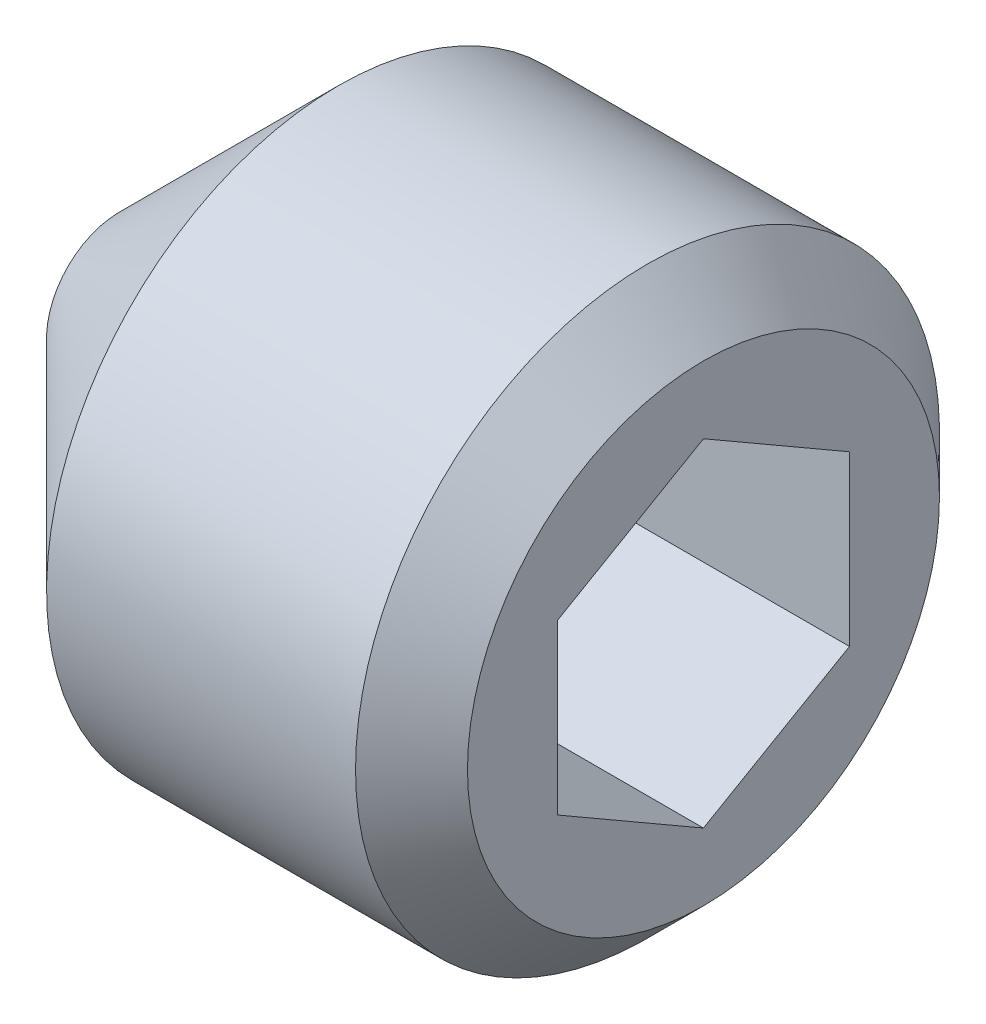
ISO-10303-21;
HEADER;
FILE_DESCRIPTION(('STEP AP214'),'2;1');
FILE_NAME('part.step','',(''),(''),'','','');
FILE_SCHEMA(('AUTOMOTIVE_DESIGN { 1 0 10303 214 1 1 1 1 }'));
ENDSEC;
DATA;
#1=APPLICATION_CONTEXT('core data for automotive mechanical design processes');
#2=APPLICATION_PROTOCOL_DEFINITION('international standard','automotive_design',2000,#1);
#3=PRODUCT_CONTEXT('',#1,'mechanical');
#4=PRODUCT('Part','Part','',(#3));
#5=PRODUCT_RELATED_PRODUCT_CATEGORY('part','',(#4));
#6=PRODUCT_DEFINITION_FORMATION('','',#4);
#7=PRODUCT_DEFINITION_CONTEXT('part definition',#1,'design');
#8=PRODUCT_DEFINITION('design','',#6,#7);
#9=PRODUCT_DEFINITION_SHAPE('','',#8);
#10=(LENGTH_UNIT() NAMED_UNIT(*) SI_UNIT(.MILLI.,.METRE.));
#11=(NAMED_UNIT(*) PLANE_ANGLE_UNIT() SI_UNIT($,.RADIAN.));
#12=(NAMED_UNIT(*) SI_UNIT($,.STERADIAN.) SOLID_ANGLE_UNIT());
#13=UNCERTAINTY_MEASURE_WITH_UNIT(LENGTH_MEASURE(1.E-05),#10,'distance_accuracy_value','');
#14=(GEOMETRIC_REPRESENTATION_CONTEXT(3) GLOBAL_UNCERTAINTY_ASSIGNED_CONTEXT((#13)) GLOBAL_UNIT_ASSIGNED_CONTEXT((#10,
#11,#12)) REPRESENTATION_CONTEXT('',''));
#15=CARTESIAN_POINT('',(0.,0.,0.));
#16=DIRECTION('',(0.,0.,1.));
#17=DIRECTION('',(1.,0.,0.));
#18=AXIS2_PLACEMENT_3D('',#15,#16,#17);
#19=CARTESIAN_POINT('',(3.00800000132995,0.,0.));
#20=DIRECTION('',(1.,0.,0.));
#21=DIRECTION('',(0.,0.,-1.));
#22=AXIS2_PLACEMENT_3D('',#19,#20,#21);
#23=CONICAL_SURFACE('',#22,2.32325748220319,1.04719754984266);
#24=CARTESIAN_POINT('',(1.66666666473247,-2.27373675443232E-10,0.));
#25=VERTEX_POINT('',#24);
#26=VERTEX_LOOP('',#25);
#27=FACE_BOUND('',#26,.T.);
#28=CARTESIAN_POINT('',(3.0000000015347,-1.15470053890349,1.9999999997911));
#29=CARTESIAN_POINT('',(2.97069554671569,-1.20544263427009,1.91211211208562));
#30=CARTESIAN_POINT('',(2.94404467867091,-1.25662273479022,1.82346557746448));
#31=CARTESIAN_POINT('',(2.89752638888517,-1.35986908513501,1.6446376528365));
#32=CARTESIAN_POINT('',(2.87767542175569,-1.4119371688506,1.55445308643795));
#33=CARTESIAN_POINT('',(2.84677596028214,-1.51542808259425,1.37520156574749));
#34=CARTESIAN_POINT('',(2.83552178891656,-1.56683499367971,1.28616218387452));
#35=CARTESIAN_POINT('',(2.82208916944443,-1.66989057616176,1.10766467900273));
#36=CARTESIAN_POINT('',(2.81989959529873,-1.72153887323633,1.01820720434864));
#37=CARTESIAN_POINT('',(2.82446629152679,-1.81803817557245,0.8510655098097));
#38=CARTESIAN_POINT('',(2.83010128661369,-1.86290366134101,0.773356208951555));
#39=CARTESIAN_POINT('',(2.84795730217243,-1.95234234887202,0.618443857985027));
#40=CARTESIAN_POINT('',(2.86018441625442,-1.99691524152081,0.541241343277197));
#41=CARTESIAN_POINT('',(2.89074983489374,-2.08653818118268,0.386009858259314));
#42=CARTESIAN_POINT('',(2.90921764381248,-2.1315768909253,0.308000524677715));
#43=CARTESIAN_POINT('',(2.95113176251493,-2.220982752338,0.153145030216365));
#44=CARTESIAN_POINT('',(2.97456823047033,-2.26535104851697,0.076296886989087));
#45=CARTESIAN_POINT('',(3.00000000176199,-2.30940107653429,3.8833644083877E-10));
#46=B_SPLINE_CURVE_WITH_KNOTS('',3,(#28,#29,#30,#31,#32,#33,#34,#35,#36,#37,#38,#39,#40,#41,#42,
#43,#44,#45),.UNSPECIFIED.,.F.,.F.,(4,2,2,2,2,2,2,2,4),(0.,0.317016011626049,0.634793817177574,
0.944707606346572,1.25424088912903,1.52370778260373,1.79342419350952,2.06912162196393,
2.34427797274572),.UNSPECIFIED.);
#47=CARTESIAN_POINT('',(3.00000000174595,-1.15470053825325,1.99999999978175));
#48=VERTEX_POINT('',#47);
#49=CARTESIAN_POINT('',(3.00000000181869,-2.3094010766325,2.1823843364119E-10));
#50=VERTEX_POINT('',#49);
#51=EDGE_CURVE('E20',#48,#50,#46,.T.);
#52=ORIENTED_EDGE('',*,*,#51,.T.);
#53=CARTESIAN_POINT('',(3.0000000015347,-2.30940107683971,-5.5845519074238E-10));
#54=CARTESIAN_POINT('',(2.97069554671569,-2.25865898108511,-0.0878878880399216));
#55=CARTESIAN_POINT('',(2.94404467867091,-2.20747888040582,-0.176534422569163));
#56=CARTESIAN_POINT('',(2.89752638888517,-2.10423252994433,-0.355362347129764));
#57=CARTESIAN_POINT('',(2.87767542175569,-2.0521644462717,-0.445546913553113));
#58=CARTESIAN_POINT('',(2.84677596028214,-1.94867353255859,-0.624798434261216));
#59=CARTESIAN_POINT('',(2.83552178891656,-1.89726662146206,-0.713837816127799));
#60=CARTESIAN_POINT('',(2.82208916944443,-1.79421103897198,-0.892335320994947));
#61=CARTESIAN_POINT('',(2.81989959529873,-1.74256274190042,-0.981792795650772));
#62=CARTESIAN_POINT('',(2.82446629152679,-1.64606343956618,-1.1489344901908));
#63=CARTESIAN_POINT('',(2.83010128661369,-1.60119795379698,-1.22664379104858));
#64=CARTESIAN_POINT('',(2.84795730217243,-1.5117592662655,-1.38155614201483));
#65=CARTESIAN_POINT('',(2.86018441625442,-1.46718637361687,-1.45875865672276));
#66=CARTESIAN_POINT('',(2.89074983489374,-1.37756343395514,-1.61399014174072));
#67=CARTESIAN_POINT('',(2.90921764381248,-1.33252472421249,-1.6919994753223));
#68=CARTESIAN_POINT('',(2.95113176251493,-1.24311886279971,-1.84685496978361));
#69=CARTESIAN_POINT('',(2.97456823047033,-1.19875056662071,-1.92370311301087));
#70=CARTESIAN_POINT('',(3.00000000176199,-1.15470053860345,-1.99999999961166));
#71=B_SPLINE_CURVE_WITH_KNOTS('',3,(#53,#54,#55,#56,#57,#58,#59,#60,#61,#62,#63,#64,#65,#66,#67,
#68,#69,#70),.UNSPECIFIED.,.F.,.F.,(4,2,2,2,2,2,2,2,4),(0.,0.31701601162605,0.634793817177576,
0.944707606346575,1.25424088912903,1.52370778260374,1.79342419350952,2.06912162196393,
2.34427797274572),.UNSPECIFIED.);
#72=CARTESIAN_POINT('',(3.00000000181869,-1.15470053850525,-1.99999999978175));
#73=VERTEX_POINT('',#72);
#74=EDGE_CURVE('E110',#50,#73,#71,.T.);
#75=ORIENTED_EDGE('',*,*,#74,.T.);
#76=CARTESIAN_POINT('',(3.0000000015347,-1.15470053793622,-2.00000000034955));
#77=CARTESIAN_POINT('',(2.97069554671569,-1.05321634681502,-2.00000000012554));
#78=CARTESIAN_POINT('',(2.94404467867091,-0.950856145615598,-2.00000000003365));
#79=CARTESIAN_POINT('',(2.89752638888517,-0.744363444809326,-1.99999999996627));
#80=CARTESIAN_POINT('',(2.87767542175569,-0.640227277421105,-1.99999999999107));
#81=CARTESIAN_POINT('',(2.84677596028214,-0.433245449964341,-2.00000000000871));
#82=CARTESIAN_POINT('',(2.83552178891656,-0.330431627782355,-2.00000000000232));
#83=CARTESIAN_POINT('',(2.82208916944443,-0.124320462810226,-1.99999999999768));
#84=CARTESIAN_POINT('',(2.81989959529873,-0.0210238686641,-1.99999999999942));
#85=CARTESIAN_POINT('',(2.82446629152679,0.171974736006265,-2.0000000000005));
#86=CARTESIAN_POINT('',(2.83010128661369,0.261705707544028,-2.00000000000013));
#87=CARTESIAN_POINT('',(2.84795730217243,0.440583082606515,-1.99999999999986));
#88=CARTESIAN_POINT('',(2.86018441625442,0.529728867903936,-1.99999999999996));
#89=CARTESIAN_POINT('',(2.89074983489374,0.708974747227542,-2.00000000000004));
#90=CARTESIAN_POINT('',(2.90921764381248,0.799052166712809,-2.00000000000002));
#91=CARTESIAN_POINT('',(2.95113176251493,0.977863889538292,-1.99999999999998));
#92=CARTESIAN_POINT('',(2.97456823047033,1.06660048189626,-1.99999999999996));
#93=CARTESIAN_POINT('',(3.00000000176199,1.15470053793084,-2.));
#94=B_SPLINE_CURVE_WITH_KNOTS('',3,(#76,#77,#78,#79,#80,#81,#82,#83,#84,#85,#86,#87,#88,#89,#90,
#91,#92,#93),.UNSPECIFIED.,.F.,.F.,(4,2,2,2,2,2,2,2,4),(0.,0.31701601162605,0.634793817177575,
0.944707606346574,1.25424088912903,1.52370778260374,1.79342419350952,2.06912162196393,
2.34427797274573),.UNSPECIFIED.);
#95=CARTESIAN_POINT('',(3.00000000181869,1.15470053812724,-1.99999999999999));
#96=VERTEX_POINT('',#95);
#97=EDGE_CURVE('E106',#73,#96,#94,.T.);
#98=ORIENTED_EDGE('',*,*,#97,.T.);
#99=CARTESIAN_POINT('',(3.00000000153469,1.15470053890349,-1.9999999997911));
#100=CARTESIAN_POINT('',(2.97069554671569,1.20544263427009,-1.91211211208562));
#101=CARTESIAN_POINT('',(2.94404467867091,1.25662273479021,-1.82346557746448));
#102=CARTESIAN_POINT('',(2.89752638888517,1.359869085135,-1.6446376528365));
#103=CARTESIAN_POINT('',(2.87767542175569,1.41193716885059,-1.55445308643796));
#104=CARTESIAN_POINT('',(2.84677596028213,1.51542808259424,-1.37520156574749));
#105=CARTESIAN_POINT('',(2.83552178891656,1.5668349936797,-1.28616218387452));
#106=CARTESIAN_POINT('',(2.82208916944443,1.66989057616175,-1.10766467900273));
#107=CARTESIAN_POINT('',(2.81989959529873,1.72153887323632,-1.01820720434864));
#108=CARTESIAN_POINT('',(2.82446629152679,1.81803817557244,-0.851065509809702));
#109=CARTESIAN_POINT('',(2.83010128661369,1.862903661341,-0.773356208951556));
#110=CARTESIAN_POINT('',(2.84795730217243,1.95234234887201,-0.618443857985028));
#111=CARTESIAN_POINT('',(2.86018441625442,1.9969152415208,-0.541241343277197));
#112=CARTESIAN_POINT('',(2.89074983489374,2.08653818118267,-0.386009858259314));
#113=CARTESIAN_POINT('',(2.90921764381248,2.13157689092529,-0.308000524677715));
#114=CARTESIAN_POINT('',(2.95113176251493,2.220982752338,-0.153145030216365));
#115=CARTESIAN_POINT('',(2.97456823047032,2.26535104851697,-0.0762968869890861));
#116=CARTESIAN_POINT('',(3.00000000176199,2.30940107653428,-3.88335300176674E-10));
#117=B_SPLINE_CURVE_WITH_KNOTS('',3,(#99,#100,#101,#102,#103,#104,#105,#106,#107,#108,#109,#110,
#111,#112,#113,#114,#115,#116),.UNSPECIFIED.,.F.,.F.,(4,2,2,2,2,2,2,2,4),(0.,0.317016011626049,
0.634793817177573,0.944707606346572,1.25424088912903,1.52370778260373,1.79342419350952,
2.06912162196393,2.34427797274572),.UNSPECIFIED.);
#118=CARTESIAN_POINT('',(3.00000000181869,2.30940107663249,-2.1824186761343E-10));
#119=VERTEX_POINT('',#118);
#120=EDGE_CURVE('E102',#96,#119,#117,.T.);
#121=ORIENTED_EDGE('',*,*,#120,.T.);
#122=CARTESIAN_POINT('',(3.00000000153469,2.3094010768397,5.58452293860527E-10));
#123=CARTESIAN_POINT('',(2.97069554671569,2.25865898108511,0.0878878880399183));
#124=CARTESIAN_POINT('',(2.94404467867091,2.20747888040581,0.176534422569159));
#125=CARTESIAN_POINT('',(2.89752638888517,2.10423252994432,0.355362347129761));
#126=CARTESIAN_POINT('',(2.87767542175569,2.05216444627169,0.445546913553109));
#127=CARTESIAN_POINT('',(2.84677596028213,1.94867353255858,0.624798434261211));
#128=CARTESIAN_POINT('',(2.83552178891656,1.89726662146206,0.713837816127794));
#129=CARTESIAN_POINT('',(2.82208916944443,1.79421103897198,0.892335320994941));
#130=CARTESIAN_POINT('',(2.81989959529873,1.74256274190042,0.981792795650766));
#131=CARTESIAN_POINT('',(2.82446629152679,1.64606343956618,1.1489344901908));
#132=CARTESIAN_POINT('',(2.83010128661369,1.60119795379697,1.22664379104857));
#133=CARTESIAN_POINT('',(2.84795730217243,1.51175926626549,1.38155614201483));
#134=CARTESIAN_POINT('',(2.86018441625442,1.46718637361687,1.45875865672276));
#135=CARTESIAN_POINT('',(2.89074983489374,1.37756343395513,1.61399014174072));
#136=CARTESIAN_POINT('',(2.90921764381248,1.33252472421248,1.6919994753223));
#137=CARTESIAN_POINT('',(2.95113176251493,1.2431188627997,1.84685496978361));
#138=CARTESIAN_POINT('',(2.97456823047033,1.1987505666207,1.92370311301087));
#139=CARTESIAN_POINT('',(3.00000000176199,1.15470053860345,1.99999999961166));
#140=B_SPLINE_CURVE_WITH_KNOTS('',3,(#122,#123,#124,#125,#126,#127,#128,#129,#130,#131,#132,
#133,#134,#135,#136,#137,#138,#139),.UNSPECIFIED.,.F.,.F.,(4,2,2,2,2,2,2,2,4),(0.,
0.317016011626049,0.634793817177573,0.944707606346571,1.25424088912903,1.52370778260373,
1.79342419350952,2.06912162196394,2.34427797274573),.UNSPECIFIED.);
#141=CARTESIAN_POINT('',(3.00000000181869,1.15470053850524,1.99999999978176));
#142=VERTEX_POINT('',#141);
#143=EDGE_CURVE('E85',#119,#142,#140,.T.);
#144=ORIENTED_EDGE('',*,*,#143,.T.);
#145=CARTESIAN_POINT('',(3.00000000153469,1.15470053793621,2.00000000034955));
#146=CARTESIAN_POINT('',(2.97069554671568,1.05321634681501,2.00000000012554));
#147=CARTESIAN_POINT('',(2.94404467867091,0.950856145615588,2.00000000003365));
#148=CARTESIAN_POINT('',(2.89752638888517,0.744363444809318,1.99999999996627));
#149=CARTESIAN_POINT('',(2.87767542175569,0.640227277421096,1.99999999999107));
#150=CARTESIAN_POINT('',(2.84677596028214,0.433245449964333,2.00000000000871));
#151=CARTESIAN_POINT('',(2.83552178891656,0.330431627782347,2.00000000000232));
#152=CARTESIAN_POINT('',(2.82208916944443,0.12432046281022,1.99999999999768));
#153=CARTESIAN_POINT('',(2.81989959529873,0.0210238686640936,1.99999999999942));
#154=CARTESIAN_POINT('',(2.82446629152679,-0.171974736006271,2.0000000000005));
#155=CARTESIAN_POINT('',(2.83010128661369,-0.261705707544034,2.00000000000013));
#156=CARTESIAN_POINT('',(2.84795730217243,-0.440583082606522,1.99999999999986));
#157=CARTESIAN_POINT('',(2.86018441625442,-0.529728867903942,1.99999999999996));
#158=CARTESIAN_POINT('',(2.89074983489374,-0.708974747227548,2.00000000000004));
#159=CARTESIAN_POINT('',(2.90921764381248,-0.799052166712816,2.00000000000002));
#160=CARTESIAN_POINT('',(2.95113176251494,-0.977863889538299,1.99999999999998));
#161=CARTESIAN_POINT('',(2.97456823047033,-1.06660048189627,1.99999999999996));
#162=CARTESIAN_POINT('',(3.000000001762,-1.15470053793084,2.));
#163=B_SPLINE_CURVE_WITH_KNOTS('',3,(#145,#146,#147,#148,#149,#150,#151,#152,#153,#154,#155,
#156,#157,#158,#159,#160,#161,#162),.UNSPECIFIED.,.F.,.F.,(4,2,2,2,2,2,2,2,4),(0.,
0.317016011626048,0.634793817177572,0.944707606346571,1.25424088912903,1.52370778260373,
1.79342419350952,2.06912162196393,2.34427797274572),.UNSPECIFIED.);
#164=EDGE_CURVE('E83',#142,#48,#163,.T.);
#165=ORIENTED_EDGE('',*,*,#164,.T.);
#166=EDGE_LOOP('',(#52,#75,#98,#121,#144,#165));
#167=FACE_BOUND('',#166,.T.);
#168=ADVANCED_FACE('F16',(#27,#167),#23,.F.);
#169=CARTESIAN_POINT('',(8.,-1.15470053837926,1.99999999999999));
#170=DIRECTION('',(0.,-0.86602540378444,0.499999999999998));
#171=DIRECTION('',(0.,-0.499999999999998,-0.86602540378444));
#172=AXIS2_PLACEMENT_3D('',#169,#170,#171);
#173=PLANE('',#172);
#174=DIRECTION('',(1.,0.,0.));
#175=VECTOR('',#174,1.);
#176=CARTESIAN_POINT('',(8.,-1.15470053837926,2.));
#177=LINE('',#176,#175);
#178=CARTESIAN_POINT('',(8.,-1.15470053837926,2.));
#179=VERTEX_POINT('',#178);
#180=EDGE_CURVE('E76',#48,#179,#177,.T.);
#181=ORIENTED_EDGE('',*,*,#180,.T.);
#182=DIRECTION('',(0.,-0.499999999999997,-0.86602540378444));
#183=VECTOR('',#182,1.);
#184=CARTESIAN_POINT('',(8.,-1.15470053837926,1.99999999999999));
#185=LINE('',#184,#183);
#186=CARTESIAN_POINT('',(8.,-2.3094010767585,0.));
#187=VERTEX_POINT('',#186);
#188=EDGE_CURVE('E87',#179,#187,#185,.T.);
#189=ORIENTED_EDGE('',*,*,#188,.T.);
#190=DIRECTION('',(1.,0.,0.));
#191=VECTOR('',#190,1.);
#192=CARTESIAN_POINT('',(8.,-2.3094010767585,0.));
#193=LINE('',#192,#191);
#194=EDGE_CURVE('E79',#187,#50,#193,.F.);
#195=ORIENTED_EDGE('',*,*,#194,.T.);
#196=ORIENTED_EDGE('',*,*,#51,.F.);
#197=EDGE_LOOP('',(#181,#189,#195,#196));
#198=FACE_BOUND('',#197,.T.);
#199=ADVANCED_FACE('F74',(#198),#173,.F.);
#200=CARTESIAN_POINT('',(8.,-2.3094010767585,0.));
#201=DIRECTION('',(0.,-0.866025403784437,-0.500000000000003));
#202=DIRECTION('',(0.,0.500000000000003,-0.866025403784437));
#203=AXIS2_PLACEMENT_3D('',#200,#201,#202);
#204=PLANE('',#203);
#205=ORIENTED_EDGE('',*,*,#194,.F.);
#206=DIRECTION('',(0.,0.500000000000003,-0.866025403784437));
#207=VECTOR('',#206,1.);
#208=CARTESIAN_POINT('',(8.,-2.3094010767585,0.));
#209=LINE('',#208,#207);
#210=CARTESIAN_POINT('',(8.,-1.15470053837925,-2.));
#211=VERTEX_POINT('',#210);
#212=EDGE_CURVE('E117',#187,#211,#209,.T.);
#213=ORIENTED_EDGE('',*,*,#212,.T.);
#214=DIRECTION('',(-1.,0.,0.));
#215=VECTOR('',#214,1.);
#216=CARTESIAN_POINT('',(8.,-1.15470053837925,-2.));
#217=LINE('',#216,#215);
#218=EDGE_CURVE('E107',#211,#73,#217,.T.);
#219=ORIENTED_EDGE('',*,*,#218,.T.);
#220=ORIENTED_EDGE('',*,*,#74,.F.);
#221=EDGE_LOOP('',(#205,#213,#219,#220));
#222=FACE_BOUND('',#221,.T.);
#223=ADVANCED_FACE('F162',(#222),#204,.F.);
#224=CARTESIAN_POINT('',(8.,-1.15470053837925,-2.));
#225=DIRECTION('',(0.,0.,-1.));
#226=DIRECTION('',(-1.,0.,0.));
#227=AXIS2_PLACEMENT_3D('',#224,#225,#226);
#228=PLANE('',#227);
#229=ORIENTED_EDGE('',*,*,#218,.F.);
#230=DIRECTION('',(0.,1.,0.));
#231=VECTOR('',#230,1.);
#232=CARTESIAN_POINT('',(8.,0.,-2.));
#233=LINE('',#232,#231);
#234=CARTESIAN_POINT('',(8.,1.15470053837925,-1.99999999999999));
#235=VERTEX_POINT('',#234);
#236=EDGE_CURVE('E119',#211,#235,#233,.T.);
#237=ORIENTED_EDGE('',*,*,#236,.T.);
#238=DIRECTION('',(1.,0.,0.));
#239=VECTOR('',#238,1.);
#240=CARTESIAN_POINT('',(8.,1.15470053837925,-1.99999999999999));
#241=LINE('',#240,#239);
#242=EDGE_CURVE('E103',#235,#96,#241,.F.);
#243=ORIENTED_EDGE('',*,*,#242,.T.);
#244=ORIENTED_EDGE('',*,*,#97,.F.);
#245=EDGE_LOOP('',(#229,#237,#243,#244));
#246=FACE_BOUND('',#245,.T.);
#247=ADVANCED_FACE('F148',(#246),#228,.F.);
#248=CARTESIAN_POINT('',(8.,1.15470053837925,-1.99999999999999));
#249=DIRECTION('',(0.,0.86602540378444,-0.499999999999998));
#250=DIRECTION('',(0.,0.499999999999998,0.86602540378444));
#251=AXIS2_PLACEMENT_3D('',#248,#249,#250);
#252=PLANE('',#251);
#253=ORIENTED_EDGE('',*,*,#242,.F.);
#254=DIRECTION('',(0.,0.5,0.866025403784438));
#255=VECTOR('',#254,1.);
#256=CARTESIAN_POINT('',(8.,1.15470053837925,-1.99999999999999));
#257=LINE('',#256,#255);
#258=CARTESIAN_POINT('',(8.,2.3094010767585,0.));
#259=VERTEX_POINT('',#258);
#260=EDGE_CURVE('E113',#235,#259,#257,.T.);
#261=ORIENTED_EDGE('',*,*,#260,.T.);
#262=DIRECTION('',(1.,0.,0.));
#263=VECTOR('',#262,1.);
#264=CARTESIAN_POINT('',(8.,2.3094010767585,0.));
#265=LINE('',#264,#263);
#266=EDGE_CURVE('E96',#259,#119,#265,.F.);
#267=ORIENTED_EDGE('',*,*,#266,.T.);
#268=ORIENTED_EDGE('',*,*,#120,.F.);
#269=EDGE_LOOP('',(#253,#261,#267,#268));
#270=FACE_BOUND('',#269,.T.);
#271=ADVANCED_FACE('F144',(#270),#252,.F.);
#272=CARTESIAN_POINT('',(8.,2.30940107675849,0.));
#273=DIRECTION('',(0.,0.866025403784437,0.500000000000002));
#274=DIRECTION('',(0.,-0.500000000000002,0.866025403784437));
#275=AXIS2_PLACEMENT_3D('',#272,#273,#274);
#276=PLANE('',#275);
#277=ORIENTED_EDGE('',*,*,#266,.F.);
#278=DIRECTION('',(0.,-0.500000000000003,0.866025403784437));
#279=VECTOR('',#278,1.);
#280=CARTESIAN_POINT('',(8.,2.3094010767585,0.));
#281=LINE('',#280,#279);
#282=CARTESIAN_POINT('',(8.,1.15470053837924,2.));
#283=VERTEX_POINT('',#282);
#284=EDGE_CURVE('E38',#259,#283,#281,.T.);
#285=ORIENTED_EDGE('',*,*,#284,.T.);
#286=DIRECTION('',(1.,0.,0.));
#287=VECTOR('',#286,1.);
#288=CARTESIAN_POINT('',(8.,1.15470053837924,2.));
#289=LINE('',#288,#287);
#290=EDGE_CURVE('E88',#283,#142,#289,.F.);
#291=ORIENTED_EDGE('',*,*,#290,.T.);
#292=ORIENTED_EDGE('',*,*,#143,.F.);
#293=EDGE_LOOP('',(#277,#285,#291,#292));
#294=FACE_BOUND('',#293,.T.);
#295=ADVANCED_FACE('F139',(#294),#276,.F.);
#296=CARTESIAN_POINT('',(8.,1.15470053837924,2.));
#297=DIRECTION('',(0.,0.,1.));
#298=DIRECTION('',(1.,0.,0.));
#299=AXIS2_PLACEMENT_3D('',#296,#297,#298);
#300=PLANE('',#299);
#301=ORIENTED_EDGE('',*,*,#290,.F.);
#302=DIRECTION('',(0.,1.,0.));
#303=VECTOR('',#302,1.);
#304=CARTESIAN_POINT('',(8.,0.,2.));
#305=LINE('',#304,#303);
#306=EDGE_CURVE('E92',#283,#179,#305,.F.);
#307=ORIENTED_EDGE('',*,*,#306,.T.);
#308=ORIENTED_EDGE('',*,*,#180,.F.);
#309=ORIENTED_EDGE('',*,*,#164,.F.);
#310=EDGE_LOOP('',(#301,#307,#308,#309));
#311=FACE_BOUND('',#310,.T.);
#312=ADVANCED_FACE('F90',(#311),#300,.F.);
#313=CARTESIAN_POINT('',(0.,2.,0.));
#314=DIRECTION('',(-1.,0.,0.));
#315=DIRECTION('',(0.,0.,1.));
#316=AXIS2_PLACEMENT_3D('',#313,#314,#315);
#317=PLANE('',#316);
#318=CARTESIAN_POINT('',(-1.30739863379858E-09,0.,0.));
#319=DIRECTION('',(1.,0.,0.));
#320=DIRECTION('',(0.,0.,-1.));
#321=AXIS2_PLACEMENT_3D('',#318,#319,#320);
#322=CIRCLE('',#321,1.00000000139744);
#323=CARTESIAN_POINT('',(-1.30739863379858E-09,0.,-1.00000000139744));
#324=VERTEX_POINT('',#323);
#325=EDGE_CURVE('E115',#324,#324,#322,.T.);
#326=ORIENTED_EDGE('',*,*,#325,.F.);
#327=EDGE_LOOP('',(#326));
#328=FACE_BOUND('',#327,.T.);
#329=ADVANCED_FACE('F138',(#328),#317,.T.);
#330=CARTESIAN_POINT('',(8.,0.,0.));
#331=DIRECTION('',(-1.,0.,0.));
#332=DIRECTION('',(0.,0.,1.));
#333=AXIS2_PLACEMENT_3D('',#330,#331,#332);
#334=PLANE('',#333);
#335=ORIENTED_EDGE('',*,*,#284,.F.);
#336=ORIENTED_EDGE('',*,*,#260,.F.);
#337=ORIENTED_EDGE('',*,*,#236,.F.);
#338=ORIENTED_EDGE('',*,*,#212,.F.);
#339=ORIENTED_EDGE('',*,*,#188,.F.);
#340=ORIENTED_EDGE('',*,*,#306,.F.);
#341=EDGE_LOOP('',(#335,#336,#337,#338,#339,#340));
#342=FACE_BOUND('',#341,.T.);
#343=CARTESIAN_POINT('',(8.00000000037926,0.,0.));
#344=DIRECTION('',(-1.,0.,0.));
#345=DIRECTION('',(0.,0.,1.));
#346=AXIS2_PLACEMENT_3D('',#343,#344,#345);
#347=CIRCLE('',#346,3.23318750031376);
#348=CARTESIAN_POINT('',(8.00000000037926,0.,3.23318750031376));
#349=VERTEX_POINT('',#348);
#350=EDGE_CURVE('E122',#349,#349,#347,.T.);
#351=ORIENTED_EDGE('',*,*,#350,.F.);
#352=EDGE_LOOP('',(#351));
#353=FACE_BOUND('',#352,.T.);
#354=ADVANCED_FACE('F187',(#342,#353),#334,.F.);
#355=CARTESIAN_POINT('',(3.0000000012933,0.,0.));
#356=DIRECTION('',(1.,0.,0.));
#357=DIRECTION('',(0.,0.,-1.));
#358=AXIS2_PLACEMENT_3D('',#355,#356,#357);
#359=CONICAL_SURFACE('',#358,3.99999999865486,0.785398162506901);
#360=CARTESIAN_POINT('',(3.,0.,0.));
#361=DIRECTION('',(1.,0.,0.));
#362=DIRECTION('',(0.,1.,0.));
#363=AXIS2_PLACEMENT_3D('',#360,#361,#362);
#364=CIRCLE('',#363,4.);
#365=CARTESIAN_POINT('',(3.,0.,-3.99999999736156));
#366=VERTEX_POINT('',#365);
#367=EDGE_CURVE('E29',#366,#366,#364,.T.);
#368=CARTESIAN_POINT('',(3.,0.,-3.99999999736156));
#369=CARTESIAN_POINT('',(2.96874999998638,0.,-3.9687499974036));
#370=CARTESIAN_POINT('',(2.93749999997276,0.,-3.93749999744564));
#371=CARTESIAN_POINT('',(2.87499999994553,0.,-3.87499999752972));
#372=CARTESIAN_POINT('',(2.84374999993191,0.,-3.84374999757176));
#373=CARTESIAN_POINT('',(2.78124999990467,0.,-3.78124999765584));
#374=CARTESIAN_POINT('',(2.74999999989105,0.,-3.74999999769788));
#375=CARTESIAN_POINT('',(2.68749999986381,0.,-3.68749999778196));
#376=CARTESIAN_POINT('',(2.65624999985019,0.,-3.656249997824));
#377=CARTESIAN_POINT('',(2.59374999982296,0.,-3.59374999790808));
#378=CARTESIAN_POINT('',(2.56249999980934,0.,-3.56249999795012));
#379=CARTESIAN_POINT('',(2.4999999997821,0.,-3.4999999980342));
#380=CARTESIAN_POINT('',(2.46874999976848,0.,-3.46874999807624));
#381=CARTESIAN_POINT('',(2.40624999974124,0.,-3.40624999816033));
#382=CARTESIAN_POINT('',(2.37499999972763,0.,-3.37499999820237));
#383=CARTESIAN_POINT('',(2.31249999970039,0.,-3.31249999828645));
#384=CARTESIAN_POINT('',(2.28124999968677,0.,-3.28124999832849));
#385=CARTESIAN_POINT('',(2.21874999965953,0.,-3.21874999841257));
#386=CARTESIAN_POINT('',(2.18749999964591,0.,-3.18749999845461));
#387=CARTESIAN_POINT('',(2.12499999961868,0.,-3.12499999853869));
#388=CARTESIAN_POINT('',(2.09374999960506,0.,-3.09374999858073));
#389=CARTESIAN_POINT('',(2.03124999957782,0.,-3.03124999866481));
#390=CARTESIAN_POINT('',(1.9999999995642,0.,-2.99999999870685));
#391=CARTESIAN_POINT('',(1.93749999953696,0.,-2.93749999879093));
#392=CARTESIAN_POINT('',(1.90624999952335,0.,-2.90624999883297));
#393=CARTESIAN_POINT('',(1.84374999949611,0.,-2.84374999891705));
#394=CARTESIAN_POINT('',(1.81249999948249,0.,-2.81249999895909));
#395=CARTESIAN_POINT('',(1.74999999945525,0.,-2.74999999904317));
#396=CARTESIAN_POINT('',(1.71874999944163,0.,-2.71874999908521));
#397=CARTESIAN_POINT('',(1.6562499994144,0.,-2.6562499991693));
#398=CARTESIAN_POINT('',(1.62499999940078,0.,-2.62499999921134));
#399=CARTESIAN_POINT('',(1.56249999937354,0.,-2.56249999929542));
#400=CARTESIAN_POINT('',(1.53124999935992,0.,-2.53124999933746));
#401=CARTESIAN_POINT('',(1.46874999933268,0.,-2.46874999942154));
#402=CARTESIAN_POINT('',(1.43749999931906,0.,-2.43749999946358));
#403=CARTESIAN_POINT('',(1.37499999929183,0.,-2.37499999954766));
#404=CARTESIAN_POINT('',(1.34374999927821,0.,-2.3437499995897));
#405=CARTESIAN_POINT('',(1.28124999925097,0.,-2.28124999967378));
#406=CARTESIAN_POINT('',(1.24999999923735,0.,-2.24999999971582));
#407=CARTESIAN_POINT('',(1.18749999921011,0.,-2.1874999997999));
#408=CARTESIAN_POINT('',(1.1562499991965,0.,-2.15624999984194));
#409=CARTESIAN_POINT('',(1.09374999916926,0.,-2.09374999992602));
#410=CARTESIAN_POINT('',(1.06249999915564,0.,-2.06249999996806));
#411=CARTESIAN_POINT('',(0.999999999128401,0.,-2.00000000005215));
#412=CARTESIAN_POINT('',(0.968749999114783,0.,-1.96875000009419));
#413=CARTESIAN_POINT('',(0.906249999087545,0.,-1.90625000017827));
#414=CARTESIAN_POINT('',(0.874999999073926,0.,-1.87500000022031));
#415=CARTESIAN_POINT('',(0.812499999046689,0.,-1.81250000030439));
#416=CARTESIAN_POINT('',(0.78124999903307,0.,-1.78125000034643));
#417=CARTESIAN_POINT('',(0.718749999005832,0.,-1.71875000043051));
#418=CARTESIAN_POINT('',(0.687499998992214,0.,-1.68750000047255));
#419=CARTESIAN_POINT('',(0.624999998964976,0.,-1.62500000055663));
#420=CARTESIAN_POINT('',(0.593749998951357,0.,-1.59375000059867));
#421=CARTESIAN_POINT('',(0.53124999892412,0.,-1.53125000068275));
#422=CARTESIAN_POINT('',(0.499999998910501,0.,-1.50000000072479));
#423=CARTESIAN_POINT('',(0.437499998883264,0.,-1.43750000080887));
#424=CARTESIAN_POINT('',(0.406249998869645,0.,-1.40625000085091));
#425=CARTESIAN_POINT('',(0.343749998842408,0.,-1.34375000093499));
#426=CARTESIAN_POINT('',(0.312499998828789,0.,-1.31250000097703));
#427=CARTESIAN_POINT('',(0.249999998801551,0.,-1.25000000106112));
#428=CARTESIAN_POINT('',(0.218749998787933,0.,-1.21875000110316));
#429=CARTESIAN_POINT('',(0.156249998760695,0.,-1.15625000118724));
#430=CARTESIAN_POINT('',(0.124999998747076,0.,-1.12500000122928));
#431=CARTESIAN_POINT('',(0.0624999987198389,0.,-1.06250000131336));
#432=CARTESIAN_POINT('',(0.0312499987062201,0.,-1.0312500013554));
#433=CARTESIAN_POINT('',(-1.30739863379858E-09,0.,-1.00000000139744));
#434=B_SPLINE_CURVE_WITH_KNOTS('',3,(#368,#369,#370,#371,#372,#373,#374,#375,#376,#377,#378,
#379,#380,#381,#382,#383,#384,#385,#386,#387,#388,#389,#390,#391,#392,#393,#394,#395,#396,#397,
#398,#399,#400,#401,#402,#403,#404,#405,#406,#407,#408,#409,#410,#411,#412,#413,#414,#415,#416,
#417,#418,#419,#420,#421,#422,#423,#424,#425,#426,#427,#428,#429,#430,#431,#432,#433),
.UNSPECIFIED.,.F.,.F.,(4,2,2,2,2,2,2,2,2,2,2,2,2,2,2,2,2,2,2,2,2,2,2,2,2,2,2,2,2,2,2,2,4),(0.,
0.132582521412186,0.265165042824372,0.397747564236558,0.530330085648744,0.66291260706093,
0.795495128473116,0.928077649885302,1.06066017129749,1.19324269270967,1.32582521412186,
1.45840773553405,1.59099025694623,1.72357277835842,1.85615529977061,1.98873782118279,
2.12132034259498,2.25390286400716,2.38648538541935,2.51906790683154,2.65165042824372,
2.78423294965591,2.91681547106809,3.04939799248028,3.18198051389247,3.31456303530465,
3.44714555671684,3.57972807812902,3.71231059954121,3.8448931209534,3.97747564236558,
4.11005816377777,4.24264068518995),.UNSPECIFIED.);
#435=EDGE_CURVE('BSEAM181',#366,#324,#434,.T.);
#436=ORIENTED_EDGE('',*,*,#367,.F.);
#437=ORIENTED_EDGE('',*,*,#325,.T.);
#438=ORIENTED_EDGE('',*,*,#435,.T.);
#439=ORIENTED_EDGE('',*,*,#435,.F.);
#440=EDGE_LOOP('',(#436,#438,#437,#439));
#441=FACE_BOUND('',#440,.T.);
#442=ADVANCED_FACE('F181',(#441),#359,.T.);
#443=CARTESIAN_POINT('',(7.23318749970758,0.,0.));
#444=DIRECTION('',(-1.,0.,0.));
#445=DIRECTION('',(0.,0.,1.));
#446=AXIS2_PLACEMENT_3D('',#443,#444,#445);
#447=CONICAL_SURFACE('',#446,3.9999999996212,0.785398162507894);
#448=ORIENTED_EDGE('',*,*,#350,.T.);
#449=EDGE_LOOP('',(#448));
#450=FACE_BOUND('',#449,.T.);
#451=CARTESIAN_POINT('',(7.2331875,0.,0.));
#452=DIRECTION('',(1.,0.,0.));
#453=DIRECTION('',(0.,1.,0.));
#454=AXIS2_PLACEMENT_3D('',#451,#452,#453);
#455=CIRCLE('',#454,4.);
#456=CARTESIAN_POINT('',(7.2331875,4.,0.));
#457=VERTEX_POINT('',#456);
#458=EDGE_CURVE('E11',#457,#457,#455,.F.);
#459=ORIENTED_EDGE('',*,*,#458,.F.);
#460=EDGE_LOOP('',(#459));
#461=FACE_BOUND('',#460,.T.);
#462=ADVANCED_FACE('F175',(#450,#461),#447,.T.);
#463=CARTESIAN_POINT('',(4.,0.,0.));
#464=DIRECTION('',(1.,0.,0.));
#465=DIRECTION('',(0.,1.,0.));
#466=AXIS2_PLACEMENT_3D('',#463,#464,#465);
#467=CYLINDRICAL_SURFACE('',#466,4.);
#468=ORIENTED_EDGE('',*,*,#458,.T.);
#469=EDGE_LOOP('',(#468));
#470=FACE_BOUND('',#469,.T.);
#471=ORIENTED_EDGE('',*,*,#367,.T.);
#472=EDGE_LOOP('',(#471));
#473=FACE_BOUND('',#472,.T.);
#474=ADVANCED_FACE('F173',(#470,#473),#467,.T.);
#475=CLOSED_SHELL('',(#168,#199,#223,#247,#271,#295,#312,#329,#354,#442,#462,#474));
#476=MANIFOLD_SOLID_BREP('B1',#475);
#477=ADVANCED_BREP_SHAPE_REPRESENTATION('',(#18,#476),#14);
#478=SHAPE_DEFINITION_REPRESENTATION(#9,#477);
ENDSEC;
END-ISO-10303-21;
